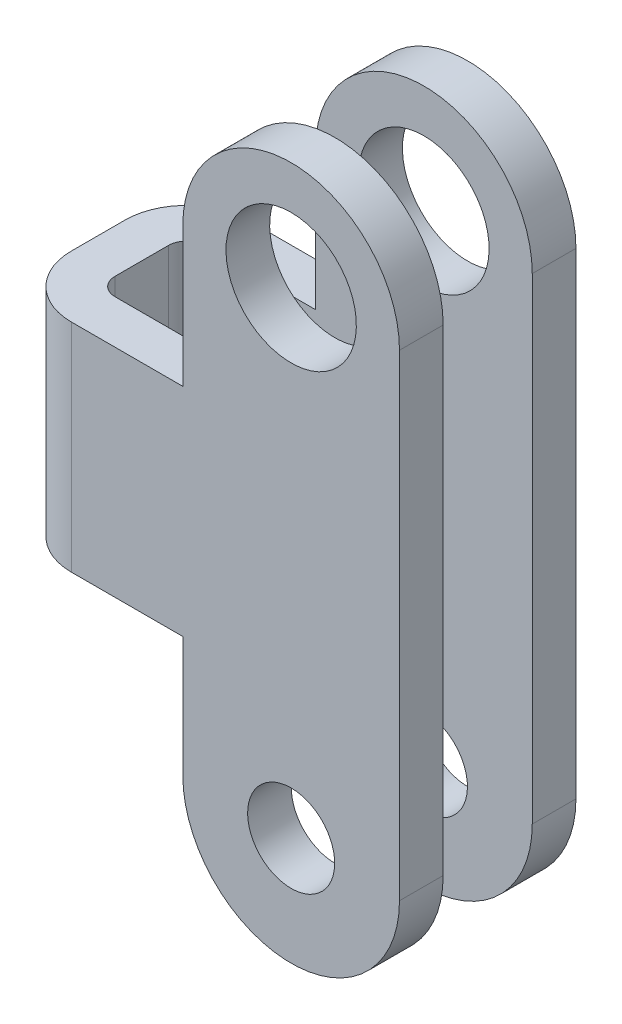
ISO-10303-21;
HEADER;
FILE_DESCRIPTION(('STEP AP214'),'2;1');
FILE_NAME('part.step','',(''),(''),'','','');
FILE_SCHEMA(('AUTOMOTIVE_DESIGN { 1 0 10303 214 1 1 1 1 }'));
ENDSEC;
DATA;
#1=APPLICATION_CONTEXT('core data for automotive mechanical design processes');
#2=APPLICATION_PROTOCOL_DEFINITION('international standard','automotive_design',2000,#1);
#3=PRODUCT_CONTEXT('',#1,'mechanical');
#4=PRODUCT('Part','Part','',(#3));
#5=PRODUCT_RELATED_PRODUCT_CATEGORY('part','',(#4));
#6=PRODUCT_DEFINITION_FORMATION('','',#4);
#7=PRODUCT_DEFINITION_CONTEXT('part definition',#1,'design');
#8=PRODUCT_DEFINITION('design','',#6,#7);
#9=PRODUCT_DEFINITION_SHAPE('','',#8);
#10=(LENGTH_UNIT() NAMED_UNIT(*) SI_UNIT(.MILLI.,.METRE.));
#11=(NAMED_UNIT(*) PLANE_ANGLE_UNIT() SI_UNIT($,.RADIAN.));
#12=(NAMED_UNIT(*) SI_UNIT($,.STERADIAN.) SOLID_ANGLE_UNIT());
#13=UNCERTAINTY_MEASURE_WITH_UNIT(LENGTH_MEASURE(1.E-05),#10,'distance_accuracy_value','');
#14=(GEOMETRIC_REPRESENTATION_CONTEXT(3) GLOBAL_UNCERTAINTY_ASSIGNED_CONTEXT((#13)) GLOBAL_UNIT_ASSIGNED_CONTEXT((#10,
#11,#12)) REPRESENTATION_CONTEXT('',''));
#15=CARTESIAN_POINT('',(0.,0.,0.));
#16=DIRECTION('',(0.,0.,1.));
#17=DIRECTION('',(1.,0.,0.));
#18=AXIS2_PLACEMENT_3D('',#15,#16,#17);
#19=CARTESIAN_POINT('',(328.945980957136,195.039056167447,0.));
#20=DIRECTION('',(0.,0.,1.));
#21=DIRECTION('',(1.,0.,0.));
#22=AXIS2_PLACEMENT_3D('',#19,#20,#21);
#23=CYLINDRICAL_SURFACE('',#22,7.935);
#24=CARTESIAN_POINT('',(328.945980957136,195.039056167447,12.925));
#25=DIRECTION('',(0.,0.,1.));
#26=DIRECTION('',(1.,0.,0.));
#27=AXIS2_PLACEMENT_3D('',#24,#25,#26);
#28=CIRCLE('',#27,7.935);
#29=CARTESIAN_POINT('',(321.010980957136,195.039056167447,12.925));
#30=VERTEX_POINT('',#29);
#31=CARTESIAN_POINT('',(336.880980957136,195.039056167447,12.925));
#32=VERTEX_POINT('',#31);
#33=EDGE_CURVE('E152',#30,#32,#28,.T.);
#34=ORIENTED_EDGE('',*,*,#33,.F.);
#35=DIRECTION('',(0.,0.,1.));
#36=VECTOR('',#35,1.);
#37=CARTESIAN_POINT('',(321.010980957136,195.039056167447,0.));
#38=LINE('',#37,#36);
#39=CARTESIAN_POINT('',(321.010980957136,195.039056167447,9.725));
#40=VERTEX_POINT('',#39);
#41=EDGE_CURVE('E145',#40,#30,#38,.T.);
#42=ORIENTED_EDGE('',*,*,#41,.F.);
#43=CARTESIAN_POINT('',(328.945980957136,195.039056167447,9.725));
#44=DIRECTION('',(0.,0.,1.));
#45=DIRECTION('',(1.,0.,0.));
#46=AXIS2_PLACEMENT_3D('',#43,#44,#45);
#47=CIRCLE('',#46,7.935);
#48=CARTESIAN_POINT('',(336.880980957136,195.039056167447,9.725));
#49=VERTEX_POINT('',#48);
#50=EDGE_CURVE('E126',#40,#49,#47,.T.);
#51=ORIENTED_EDGE('',*,*,#50,.T.);
#52=DIRECTION('',(0.,0.,-1.));
#53=VECTOR('',#52,1.);
#54=CARTESIAN_POINT('',(336.880980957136,195.039056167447,0.));
#55=LINE('',#54,#53);
#56=EDGE_CURVE('E157',#32,#49,#55,.T.);
#57=ORIENTED_EDGE('',*,*,#56,.F.);
#58=EDGE_LOOP('',(#34,#42,#51,#57));
#59=FACE_BOUND('',#58,.T.);
#60=ADVANCED_FACE('F15',(#59),#23,.T.);
#61=CARTESIAN_POINT('',(336.880980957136,229.959056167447,0.));
#62=DIRECTION('',(1.,0.,0.));
#63=DIRECTION('',(0.,0.,-1.));
#64=AXIS2_PLACEMENT_3D('',#61,#62,#63);
#65=PLANE('',#64);
#66=DIRECTION('',(0.,-1.,0.));
#67=VECTOR('',#66,1.);
#68=CARTESIAN_POINT('',(336.880980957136,212.376796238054,12.925));
#69=LINE('',#68,#67);
#70=CARTESIAN_POINT('',(336.880980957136,229.959056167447,12.925));
#71=VERTEX_POINT('',#70);
#72=EDGE_CURVE('E226',#32,#71,#69,.F.);
#73=ORIENTED_EDGE('',*,*,#72,.F.);
#74=ORIENTED_EDGE('',*,*,#56,.T.);
#75=DIRECTION('',(0.,-1.,0.));
#76=VECTOR('',#75,1.);
#77=CARTESIAN_POINT('',(336.880980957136,193.864056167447,9.725));
#78=LINE('',#77,#76);
#79=CARTESIAN_POINT('',(336.880980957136,229.959056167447,9.725));
#80=VERTEX_POINT('',#79);
#81=EDGE_CURVE('E136',#49,#80,#78,.F.);
#82=ORIENTED_EDGE('',*,*,#81,.T.);
#83=DIRECTION('',(0.,0.,1.));
#84=VECTOR('',#83,1.);
#85=CARTESIAN_POINT('',(336.880980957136,229.959056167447,0.));
#86=LINE('',#85,#84);
#87=EDGE_CURVE('E237',#71,#80,#86,.F.);
#88=ORIENTED_EDGE('',*,*,#87,.F.);
#89=EDGE_LOOP('',(#73,#74,#82,#88));
#90=FACE_BOUND('',#89,.T.);
#91=ADVANCED_FACE('F396',(#90),#65,.T.);
#92=CARTESIAN_POINT('',(328.945980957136,229.959056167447,0.));
#93=DIRECTION('',(0.,0.,1.));
#94=DIRECTION('',(1.,0.,0.));
#95=AXIS2_PLACEMENT_3D('',#92,#93,#94);
#96=CYLINDRICAL_SURFACE('',#95,7.935);
#97=CARTESIAN_POINT('',(328.945980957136,229.959056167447,12.925));
#98=DIRECTION('',(0.,0.,1.));
#99=DIRECTION('',(1.,0.,0.));
#100=AXIS2_PLACEMENT_3D('',#97,#98,#99);
#101=CIRCLE('',#100,7.935);
#102=CARTESIAN_POINT('',(321.010980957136,229.959056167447,12.925));
#103=VERTEX_POINT('',#102);
#104=EDGE_CURVE('E224',#71,#103,#101,.T.);
#105=ORIENTED_EDGE('',*,*,#104,.F.);
#106=ORIENTED_EDGE('',*,*,#87,.T.);
#107=CARTESIAN_POINT('',(328.945980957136,229.959056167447,9.725));
#108=DIRECTION('',(0.,0.,1.));
#109=DIRECTION('',(1.,0.,0.));
#110=AXIS2_PLACEMENT_3D('',#107,#108,#109);
#111=CIRCLE('',#110,7.935);
#112=CARTESIAN_POINT('',(321.010980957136,229.959056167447,9.725));
#113=VERTEX_POINT('',#112);
#114=EDGE_CURVE('E228',#80,#113,#111,.T.);
#115=ORIENTED_EDGE('',*,*,#114,.T.);
#116=DIRECTION('',(0.,0.,1.));
#117=VECTOR('',#116,1.);
#118=CARTESIAN_POINT('',(321.010980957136,229.959056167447,0.));
#119=LINE('',#118,#117);
#120=EDGE_CURVE('E234',#103,#113,#119,.F.);
#121=ORIENTED_EDGE('',*,*,#120,.F.);
#122=EDGE_LOOP('',(#105,#106,#115,#121));
#123=FACE_BOUND('',#122,.T.);
#124=ADVANCED_FACE('F392',(#123),#96,.T.);
#125=CARTESIAN_POINT('',(328.945980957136,195.039056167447,-46.7484945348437));
#126=DIRECTION('',(0.,0.,-1.));
#127=DIRECTION('',(0.,1.,0.));
#128=AXIS2_PLACEMENT_3D('',#125,#126,#127);
#129=CYLINDRICAL_SURFACE('',#128,3.1875);
#130=CARTESIAN_POINT('',(328.945980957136,195.039056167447,12.925));
#131=DIRECTION('',(0.,0.,-1.));
#132=DIRECTION('',(0.,1.,0.));
#133=AXIS2_PLACEMENT_3D('',#130,#131,#132);
#134=CIRCLE('',#133,3.1875);
#135=CARTESIAN_POINT('',(328.945980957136,198.226556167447,12.925));
#136=VERTEX_POINT('',#135);
#137=EDGE_CURVE('E220',#136,#136,#134,.T.);
#138=ORIENTED_EDGE('',*,*,#137,.F.);
#139=EDGE_LOOP('',(#138));
#140=FACE_BOUND('',#139,.T.);
#141=CARTESIAN_POINT('',(328.945980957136,195.039056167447,9.725));
#142=DIRECTION('',(0.,0.,-1.));
#143=DIRECTION('',(0.,1.,0.));
#144=AXIS2_PLACEMENT_3D('',#141,#142,#143);
#145=CIRCLE('',#144,3.1875);
#146=CARTESIAN_POINT('',(328.945980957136,198.226556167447,9.725));
#147=VERTEX_POINT('',#146);
#148=EDGE_CURVE('E140',#147,#147,#145,.T.);
#149=ORIENTED_EDGE('',*,*,#148,.T.);
#150=EDGE_LOOP('',(#149));
#151=FACE_BOUND('',#150,.T.);
#152=ADVANCED_FACE('F591',(#140,#151),#129,.F.);
#153=CARTESIAN_POINT('',(328.945980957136,229.959056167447,-46.7484945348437));
#154=DIRECTION('',(0.,0.,-1.));
#155=DIRECTION('',(0.,1.,0.));
#156=AXIS2_PLACEMENT_3D('',#153,#154,#155);
#157=CYLINDRICAL_SURFACE('',#156,4.775);
#158=CARTESIAN_POINT('',(328.945980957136,229.959056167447,12.925));
#159=DIRECTION('',(0.,0.,-1.));
#160=DIRECTION('',(0.,1.,0.));
#161=AXIS2_PLACEMENT_3D('',#158,#159,#160);
#162=CIRCLE('',#161,4.775);
#163=CARTESIAN_POINT('',(328.945980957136,234.734056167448,12.925));
#164=VERTEX_POINT('',#163);
#165=EDGE_CURVE('E216',#164,#164,#162,.T.);
#166=ORIENTED_EDGE('',*,*,#165,.F.);
#167=EDGE_LOOP('',(#166));
#168=FACE_BOUND('',#167,.T.);
#169=CARTESIAN_POINT('',(328.945980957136,229.959056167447,9.725));
#170=DIRECTION('',(0.,0.,-1.));
#171=DIRECTION('',(0.,1.,0.));
#172=AXIS2_PLACEMENT_3D('',#169,#170,#171);
#173=CIRCLE('',#172,4.775);
#174=CARTESIAN_POINT('',(328.945980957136,234.734056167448,9.725));
#175=VERTEX_POINT('',#174);
#176=EDGE_CURVE('E18',#175,#175,#173,.T.);
#177=ORIENTED_EDGE('',*,*,#176,.T.);
#178=EDGE_LOOP('',(#177));
#179=FACE_BOUND('',#178,.T.);
#180=ADVANCED_FACE('F583',(#168,#179),#157,.F.);
#181=CARTESIAN_POINT('',(321.010980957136,219.734056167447,0.));
#182=DIRECTION('',(-1.,0.,0.));
#183=DIRECTION('',(0.,-1.,0.));
#184=AXIS2_PLACEMENT_3D('',#181,#182,#183);
#185=PLANE('',#184);
#186=DIRECTION('',(0.,-1.,0.));
#187=VECTOR('',#186,1.);
#188=CARTESIAN_POINT('',(321.010980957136,212.376796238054,12.925));
#189=LINE('',#188,#187);
#190=CARTESIAN_POINT('',(321.010980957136,219.734056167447,12.925));
#191=VERTEX_POINT('',#190);
#192=EDGE_CURVE('E223',#103,#191,#189,.T.);
#193=ORIENTED_EDGE('',*,*,#192,.F.);
#194=ORIENTED_EDGE('',*,*,#120,.T.);
#195=DIRECTION('',(0.,-1.,0.));
#196=VECTOR('',#195,1.);
#197=CARTESIAN_POINT('',(321.010980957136,193.864056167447,9.725));
#198=LINE('',#197,#196);
#199=CARTESIAN_POINT('',(321.010980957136,219.734056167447,9.725));
#200=VERTEX_POINT('',#199);
#201=EDGE_CURVE('E149',#113,#200,#198,.T.);
#202=ORIENTED_EDGE('',*,*,#201,.T.);
#203=DIRECTION('',(0.,0.,1.));
#204=VECTOR('',#203,1.);
#205=CARTESIAN_POINT('',(321.010980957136,219.734056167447,0.));
#206=LINE('',#205,#204);
#207=EDGE_CURVE('E245',#191,#200,#206,.F.);
#208=ORIENTED_EDGE('',*,*,#207,.F.);
#209=EDGE_LOOP('',(#193,#194,#202,#208));
#210=FACE_BOUND('',#209,.T.);
#211=ADVANCED_FACE('F387',(#210),#185,.T.);
#212=CARTESIAN_POINT('',(311.545980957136,193.864056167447,9.725));
#213=DIRECTION('',(0.,0.,1.));
#214=DIRECTION('',(0.,-1.,0.));
#215=AXIS2_PLACEMENT_3D('',#212,#213,#214);
#216=PLANE('',#215);
#217=DIRECTION('',(1.,0.,0.));
#218=VECTOR('',#217,1.);
#219=CARTESIAN_POINT('',(308.345980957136,219.734056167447,9.725));
#220=LINE('',#219,#218);
#221=CARTESIAN_POINT('',(312.845980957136,219.734056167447,9.725));
#222=VERTEX_POINT('',#221);
#223=EDGE_CURVE('E215',#200,#222,#220,.F.);
#224=ORIENTED_EDGE('',*,*,#223,.F.);
#225=ORIENTED_EDGE('',*,*,#201,.F.);
#226=ORIENTED_EDGE('',*,*,#114,.F.);
#227=ORIENTED_EDGE('',*,*,#81,.F.);
#228=ORIENTED_EDGE('',*,*,#50,.F.);
#229=DIRECTION('',(0.,-1.,0.));
#230=VECTOR('',#229,1.);
#231=CARTESIAN_POINT('',(321.010980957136,195.039056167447,9.725));
#232=LINE('',#231,#230);
#233=CARTESIAN_POINT('',(321.010980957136,203.864056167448,9.725));
#234=VERTEX_POINT('',#233);
#235=EDGE_CURVE('E132',#234,#40,#232,.T.);
#236=ORIENTED_EDGE('',*,*,#235,.F.);
#237=DIRECTION('',(1.,0.,0.));
#238=VECTOR('',#237,1.);
#239=CARTESIAN_POINT('',(321.010980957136,203.864056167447,9.725));
#240=LINE('',#239,#238);
#241=CARTESIAN_POINT('',(312.845980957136,203.864056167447,9.725));
#242=VERTEX_POINT('',#241);
#243=EDGE_CURVE('E255',#242,#234,#240,.T.);
#244=ORIENTED_EDGE('',*,*,#243,.F.);
#245=DIRECTION('',(0.,-1.,0.));
#246=VECTOR('',#245,1.);
#247=CARTESIAN_POINT('',(312.845980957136,193.864056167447,9.725));
#248=LINE('',#247,#246);
#249=EDGE_CURVE('E265',#222,#242,#248,.T.);
#250=ORIENTED_EDGE('',*,*,#249,.F.);
#251=EDGE_LOOP('',(#224,#225,#226,#227,#228,#236,#244,#250));
#252=FACE_BOUND('',#251,.T.);
#253=ORIENTED_EDGE('',*,*,#148,.F.);
#254=EDGE_LOOP('',(#253));
#255=FACE_BOUND('',#254,.T.);
#256=ORIENTED_EDGE('',*,*,#176,.F.);
#257=EDGE_LOOP('',(#256));
#258=FACE_BOUND('',#257,.T.);
#259=ADVANCED_FACE('F129',(#252,#255,#258),#216,.F.);
#260=CARTESIAN_POINT('',(321.010980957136,195.039056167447,0.));
#261=DIRECTION('',(-1.,0.,0.));
#262=DIRECTION('',(0.,-1.,0.));
#263=AXIS2_PLACEMENT_3D('',#260,#261,#262);
#264=PLANE('',#263);
#265=DIRECTION('',(0.,-1.,0.));
#266=VECTOR('',#265,1.);
#267=CARTESIAN_POINT('',(321.010980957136,212.376796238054,12.925));
#268=LINE('',#267,#266);
#269=CARTESIAN_POINT('',(321.010980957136,203.864056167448,12.925));
#270=VERTEX_POINT('',#269);
#271=EDGE_CURVE('E153',#270,#30,#268,.T.);
#272=ORIENTED_EDGE('',*,*,#271,.F.);
#273=DIRECTION('',(0.,0.,1.));
#274=VECTOR('',#273,1.);
#275=CARTESIAN_POINT('',(321.010980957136,203.864056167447,0.));
#276=LINE('',#275,#274);
#277=EDGE_CURVE('E148',#234,#270,#276,.T.);
#278=ORIENTED_EDGE('',*,*,#277,.F.);
#279=ORIENTED_EDGE('',*,*,#235,.T.);
#280=ORIENTED_EDGE('',*,*,#41,.T.);
#281=EDGE_LOOP('',(#272,#278,#279,#280));
#282=FACE_BOUND('',#281,.T.);
#283=ADVANCED_FACE('F144',(#282),#264,.T.);
#284=CARTESIAN_POINT('',(325.068157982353,212.376796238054,12.925));
#285=DIRECTION('',(0.,0.,1.));
#286=DIRECTION('',(0.,-1.,0.));
#287=AXIS2_PLACEMENT_3D('',#284,#285,#286);
#288=PLANE('',#287);
#289=ORIENTED_EDGE('',*,*,#165,.T.);
#290=EDGE_LOOP('',(#289));
#291=FACE_BOUND('',#290,.T.);
#292=ORIENTED_EDGE('',*,*,#137,.T.);
#293=EDGE_LOOP('',(#292));
#294=FACE_BOUND('',#293,.T.);
#295=ORIENTED_EDGE('',*,*,#192,.T.);
#296=DIRECTION('',(1.,0.,0.));
#297=VECTOR('',#296,1.);
#298=CARTESIAN_POINT('',(308.345980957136,219.734056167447,12.925));
#299=LINE('',#298,#297);
#300=CARTESIAN_POINT('',(312.845980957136,219.734056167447,12.925));
#301=VERTEX_POINT('',#300);
#302=EDGE_CURVE('E206',#301,#191,#299,.T.);
#303=ORIENTED_EDGE('',*,*,#302,.F.);
#304=DIRECTION('',(0.,1.,0.));
#305=VECTOR('',#304,1.);
#306=CARTESIAN_POINT('',(312.845980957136,208.120426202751,12.925));
#307=LINE('',#306,#305);
#308=CARTESIAN_POINT('',(312.845980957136,203.864056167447,12.925));
#309=VERTEX_POINT('',#308);
#310=EDGE_CURVE('E219',#309,#301,#307,.T.);
#311=ORIENTED_EDGE('',*,*,#310,.F.);
#312=DIRECTION('',(1.,0.,0.));
#313=VECTOR('',#312,1.);
#314=CARTESIAN_POINT('',(321.010980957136,203.864056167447,12.925));
#315=LINE('',#314,#313);
#316=EDGE_CURVE('E194',#270,#309,#315,.F.);
#317=ORIENTED_EDGE('',*,*,#316,.F.);
#318=ORIENTED_EDGE('',*,*,#271,.T.);
#319=ORIENTED_EDGE('',*,*,#33,.T.);
#320=ORIENTED_EDGE('',*,*,#72,.T.);
#321=ORIENTED_EDGE('',*,*,#104,.T.);
#322=EDGE_LOOP('',(#295,#303,#311,#317,#318,#319,#320,#321));
#323=FACE_BOUND('',#322,.T.);
#324=ADVANCED_FACE('F384',(#291,#294,#323),#288,.T.);
#325=CARTESIAN_POINT('',(312.845980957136,208.120426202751,8.425));
#326=DIRECTION('',(0.,1.,0.));
#327=DIRECTION('',(0.,0.,1.));
#328=AXIS2_PLACEMENT_3D('',#325,#326,#327);
#329=CYLINDRICAL_SURFACE('',#328,4.5);
#330=CARTESIAN_POINT('',(312.845980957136,203.864056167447,8.425));
#331=DIRECTION('',(0.,1.,0.));
#332=DIRECTION('',(0.,0.,1.));
#333=AXIS2_PLACEMENT_3D('',#330,#331,#332);
#334=CIRCLE('',#333,4.5);
#335=CARTESIAN_POINT('',(308.345980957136,203.864056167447,8.425));
#336=VERTEX_POINT('',#335);
#337=EDGE_CURVE('E192',#309,#336,#334,.F.);
#338=ORIENTED_EDGE('',*,*,#337,.F.);
#339=ORIENTED_EDGE('',*,*,#310,.T.);
#340=CARTESIAN_POINT('',(312.845980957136,219.734056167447,8.425));
#341=DIRECTION('',(0.,1.,0.));
#342=DIRECTION('',(0.,0.,1.));
#343=AXIS2_PLACEMENT_3D('',#340,#341,#342);
#344=CIRCLE('',#343,4.5);
#345=CARTESIAN_POINT('',(308.345980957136,219.734056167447,8.425));
#346=VERTEX_POINT('',#345);
#347=EDGE_CURVE('E203',#346,#301,#344,.T.);
#348=ORIENTED_EDGE('',*,*,#347,.F.);
#349=DIRECTION('',(0.,1.,0.));
#350=VECTOR('',#349,1.);
#351=CARTESIAN_POINT('',(308.345980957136,203.864056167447,8.425));
#352=LINE('',#351,#350);
#353=EDGE_CURVE('E261',#336,#346,#352,.T.);
#354=ORIENTED_EDGE('',*,*,#353,.F.);
#355=EDGE_LOOP('',(#338,#339,#348,#354));
#356=FACE_BOUND('',#355,.T.);
#357=ADVANCED_FACE('F380',(#356),#329,.T.);
#358=CARTESIAN_POINT('',(308.345980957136,203.864056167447,0.));
#359=DIRECTION('',(-1.,0.,0.));
#360=DIRECTION('',(0.,0.,1.));
#361=AXIS2_PLACEMENT_3D('',#358,#359,#360);
#362=PLANE('',#361);
#363=ORIENTED_EDGE('',*,*,#353,.T.);
#364=DIRECTION('',(0.,0.,1.));
#365=VECTOR('',#364,1.);
#366=CARTESIAN_POINT('',(308.345980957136,219.734056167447,0.));
#367=LINE('',#366,#365);
#368=CARTESIAN_POINT('',(308.345980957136,219.734056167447,4.5));
#369=VERTEX_POINT('',#368);
#370=EDGE_CURVE('E207',#369,#346,#367,.T.);
#371=ORIENTED_EDGE('',*,*,#370,.F.);
#372=DIRECTION('',(0.,1.,0.));
#373=VECTOR('',#372,1.);
#374=CARTESIAN_POINT('',(308.345980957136,208.120426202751,4.5));
#375=LINE('',#374,#373);
#376=CARTESIAN_POINT('',(308.345980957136,203.864056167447,4.5));
#377=VERTEX_POINT('',#376);
#378=EDGE_CURVE('E263',#377,#369,#375,.T.);
#379=ORIENTED_EDGE('',*,*,#378,.F.);
#380=DIRECTION('',(0.,0.,1.));
#381=VECTOR('',#380,1.);
#382=CARTESIAN_POINT('',(308.345980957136,203.864056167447,0.));
#383=LINE('',#382,#381);
#384=EDGE_CURVE('E191',#336,#377,#383,.F.);
#385=ORIENTED_EDGE('',*,*,#384,.F.);
#386=EDGE_LOOP('',(#363,#371,#379,#385));
#387=FACE_BOUND('',#386,.T.);
#388=ADVANCED_FACE('F374',(#387),#362,.T.);
#389=CARTESIAN_POINT('',(312.845980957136,208.120426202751,4.5));
#390=DIRECTION('',(0.,1.,0.));
#391=DIRECTION('',(0.,0.,1.));
#392=AXIS2_PLACEMENT_3D('',#389,#390,#391);
#393=CYLINDRICAL_SURFACE('',#392,4.5);
#394=CARTESIAN_POINT('',(312.845980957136,203.864056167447,4.5));
#395=DIRECTION('',(0.,1.,0.));
#396=DIRECTION('',(0.,0.,1.));
#397=AXIS2_PLACEMENT_3D('',#394,#395,#396);
#398=CIRCLE('',#397,4.5);
#399=CARTESIAN_POINT('',(312.845980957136,203.864056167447,0.));
#400=VERTEX_POINT('',#399);
#401=EDGE_CURVE('E188',#377,#400,#398,.F.);
#402=ORIENTED_EDGE('',*,*,#401,.F.);
#403=ORIENTED_EDGE('',*,*,#378,.T.);
#404=CARTESIAN_POINT('',(312.845980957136,219.734056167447,4.5));
#405=DIRECTION('',(0.,1.,0.));
#406=DIRECTION('',(0.,0.,1.));
#407=AXIS2_PLACEMENT_3D('',#404,#405,#406);
#408=CIRCLE('',#407,4.5);
#409=CARTESIAN_POINT('',(312.845980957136,219.734056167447,0.));
#410=VERTEX_POINT('',#409);
#411=EDGE_CURVE('E208',#410,#369,#408,.T.);
#412=ORIENTED_EDGE('',*,*,#411,.F.);
#413=DIRECTION('',(0.,-1.,0.));
#414=VECTOR('',#413,1.);
#415=CARTESIAN_POINT('',(312.845980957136,212.376796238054,0.));
#416=LINE('',#415,#414);
#417=EDGE_CURVE('E266',#410,#400,#416,.T.);
#418=ORIENTED_EDGE('',*,*,#417,.T.);
#419=EDGE_LOOP('',(#402,#403,#412,#418));
#420=FACE_BOUND('',#419,.T.);
#421=ADVANCED_FACE('F370',(#420),#393,.T.);
#422=CARTESIAN_POINT('',(312.845980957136,219.734056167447,8.425));
#423=DIRECTION('',(0.,-1.,0.));
#424=DIRECTION('',(1.,0.,0.));
#425=AXIS2_PLACEMENT_3D('',#422,#423,#424);
#426=CYLINDRICAL_SURFACE('',#425,1.3);
#427=CARTESIAN_POINT('',(312.845980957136,203.864056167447,8.425));
#428=DIRECTION('',(0.,-1.,0.));
#429=DIRECTION('',(1.,0.,0.));
#430=AXIS2_PLACEMENT_3D('',#427,#428,#429);
#431=CIRCLE('',#430,1.3);
#432=CARTESIAN_POINT('',(311.545980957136,203.864056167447,8.425));
#433=VERTEX_POINT('',#432);
#434=EDGE_CURVE('E184',#433,#242,#431,.F.);
#435=ORIENTED_EDGE('',*,*,#434,.F.);
#436=DIRECTION('',(0.,-1.,0.));
#437=VECTOR('',#436,1.);
#438=CARTESIAN_POINT('',(311.545980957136,193.864056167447,8.425));
#439=LINE('',#438,#437);
#440=CARTESIAN_POINT('',(311.545980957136,219.734056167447,8.425));
#441=VERTEX_POINT('',#440);
#442=EDGE_CURVE('E269',#433,#441,#439,.F.);
#443=ORIENTED_EDGE('',*,*,#442,.T.);
#444=CARTESIAN_POINT('',(312.845980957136,219.734056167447,8.425));
#445=DIRECTION('',(0.,-1.,0.));
#446=DIRECTION('',(1.,0.,0.));
#447=AXIS2_PLACEMENT_3D('',#444,#445,#446);
#448=CIRCLE('',#447,1.3);
#449=EDGE_CURVE('E212',#222,#441,#448,.T.);
#450=ORIENTED_EDGE('',*,*,#449,.F.);
#451=ORIENTED_EDGE('',*,*,#249,.T.);
#452=EDGE_LOOP('',(#435,#443,#450,#451));
#453=FACE_BOUND('',#452,.T.);
#454=ADVANCED_FACE('F403',(#453),#426,.F.);
#455=CARTESIAN_POINT('',(311.545980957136,193.864056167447,3.2));
#456=DIRECTION('',(-1.,0.,0.));
#457=DIRECTION('',(0.,-1.,0.));
#458=AXIS2_PLACEMENT_3D('',#455,#456,#457);
#459=PLANE('',#458);
#460=DIRECTION('',(0.,0.,1.));
#461=VECTOR('',#460,1.);
#462=CARTESIAN_POINT('',(311.545980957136,219.734056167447,0.));
#463=LINE('',#462,#461);
#464=CARTESIAN_POINT('',(311.545980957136,219.734056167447,4.5));
#465=VERTEX_POINT('',#464);
#466=EDGE_CURVE('E214',#441,#465,#463,.F.);
#467=ORIENTED_EDGE('',*,*,#466,.F.);
#468=ORIENTED_EDGE('',*,*,#442,.F.);
#469=DIRECTION('',(0.,0.,1.));
#470=VECTOR('',#469,1.);
#471=CARTESIAN_POINT('',(311.545980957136,203.864056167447,0.));
#472=LINE('',#471,#470);
#473=CARTESIAN_POINT('',(311.545980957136,203.864056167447,4.5));
#474=VERTEX_POINT('',#473);
#475=EDGE_CURVE('E187',#474,#433,#472,.T.);
#476=ORIENTED_EDGE('',*,*,#475,.F.);
#477=DIRECTION('',(0.,-1.,0.));
#478=VECTOR('',#477,1.);
#479=CARTESIAN_POINT('',(311.545980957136,193.864056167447,4.5));
#480=LINE('',#479,#478);
#481=EDGE_CURVE('E180',#465,#474,#480,.T.);
#482=ORIENTED_EDGE('',*,*,#481,.F.);
#483=EDGE_LOOP('',(#467,#468,#476,#482));
#484=FACE_BOUND('',#483,.T.);
#485=ADVANCED_FACE('F406',(#484),#459,.F.);
#486=CARTESIAN_POINT('',(325.068157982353,212.376796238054,0.));
#487=DIRECTION('',(0.,0.,1.));
#488=DIRECTION('',(0.,-1.,0.));
#489=AXIS2_PLACEMENT_3D('',#486,#487,#488);
#490=PLANE('',#489);
#491=CARTESIAN_POINT('',(328.945980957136,195.039056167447,0.));
#492=DIRECTION('',(0.,0.,-1.));
#493=DIRECTION('',(0.,1.,0.));
#494=AXIS2_PLACEMENT_3D('',#491,#492,#493);
#495=CIRCLE('',#494,3.1875);
#496=CARTESIAN_POINT('',(328.945980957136,198.226556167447,0.));
#497=VERTEX_POINT('',#496);
#498=EDGE_CURVE('E172',#497,#497,#495,.F.);
#499=ORIENTED_EDGE('',*,*,#498,.T.);
#500=EDGE_LOOP('',(#499));
#501=FACE_BOUND('',#500,.T.);
#502=CARTESIAN_POINT('',(328.945980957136,229.959056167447,0.));
#503=DIRECTION('',(0.,0.,-1.));
#504=DIRECTION('',(0.,1.,0.));
#505=AXIS2_PLACEMENT_3D('',#502,#503,#504);
#506=CIRCLE('',#505,4.775);
#507=CARTESIAN_POINT('',(328.945980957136,234.734056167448,0.));
#508=VERTEX_POINT('',#507);
#509=EDGE_CURVE('E176',#508,#508,#506,.F.);
#510=ORIENTED_EDGE('',*,*,#509,.T.);
#511=EDGE_LOOP('',(#510));
#512=FACE_BOUND('',#511,.T.);
#513=DIRECTION('',(1.,0.,0.));
#514=VECTOR('',#513,1.);
#515=CARTESIAN_POINT('',(308.345980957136,219.734056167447,0.));
#516=LINE('',#515,#514);
#517=CARTESIAN_POINT('',(321.010980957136,219.734056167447,0.));
#518=VERTEX_POINT('',#517);
#519=EDGE_CURVE('E211',#518,#410,#516,.F.);
#520=ORIENTED_EDGE('',*,*,#519,.F.);
#521=DIRECTION('',(0.,-1.,0.));
#522=VECTOR('',#521,1.);
#523=CARTESIAN_POINT('',(321.010980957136,219.734056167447,0.));
#524=LINE('',#523,#522);
#525=CARTESIAN_POINT('',(321.010980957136,229.959056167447,0.));
#526=VERTEX_POINT('',#525);
#527=EDGE_CURVE('E248',#526,#518,#524,.T.);
#528=ORIENTED_EDGE('',*,*,#527,.F.);
#529=CARTESIAN_POINT('',(328.945980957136,229.959056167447,0.));
#530=DIRECTION('',(0.,0.,1.));
#531=DIRECTION('',(1.,0.,0.));
#532=AXIS2_PLACEMENT_3D('',#529,#530,#531);
#533=CIRCLE('',#532,7.935);
#534=CARTESIAN_POINT('',(336.880980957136,229.959056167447,0.));
#535=VERTEX_POINT('',#534);
#536=EDGE_CURVE('E199',#535,#526,#533,.T.);
#537=ORIENTED_EDGE('',*,*,#536,.F.);
#538=DIRECTION('',(0.,1.,0.));
#539=VECTOR('',#538,1.);
#540=CARTESIAN_POINT('',(336.880980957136,229.959056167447,0.));
#541=LINE('',#540,#539);
#542=CARTESIAN_POINT('',(336.880980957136,195.039056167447,0.));
#543=VERTEX_POINT('',#542);
#544=EDGE_CURVE('E251',#543,#535,#541,.T.);
#545=ORIENTED_EDGE('',*,*,#544,.F.);
#546=CARTESIAN_POINT('',(328.945980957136,195.039056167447,0.));
#547=DIRECTION('',(0.,0.,1.));
#548=DIRECTION('',(1.,0.,0.));
#549=AXIS2_PLACEMENT_3D('',#546,#547,#548);
#550=CIRCLE('',#549,7.935);
#551=CARTESIAN_POINT('',(321.010980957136,195.039056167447,0.));
#552=VERTEX_POINT('',#551);
#553=EDGE_CURVE('E195',#552,#543,#550,.T.);
#554=ORIENTED_EDGE('',*,*,#553,.F.);
#555=DIRECTION('',(0.,-1.,0.));
#556=VECTOR('',#555,1.);
#557=CARTESIAN_POINT('',(321.010980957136,195.039056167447,0.));
#558=LINE('',#557,#556);
#559=CARTESIAN_POINT('',(321.010980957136,203.864056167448,0.));
#560=VERTEX_POINT('',#559);
#561=EDGE_CURVE('E270',#560,#552,#558,.T.);
#562=ORIENTED_EDGE('',*,*,#561,.F.);
#563=DIRECTION('',(1.,0.,0.));
#564=VECTOR('',#563,1.);
#565=CARTESIAN_POINT('',(321.010980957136,203.864056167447,0.));
#566=LINE('',#565,#564);
#567=EDGE_CURVE('E190',#400,#560,#566,.T.);
#568=ORIENTED_EDGE('',*,*,#567,.F.);
#569=ORIENTED_EDGE('',*,*,#417,.F.);
#570=EDGE_LOOP('',(#520,#528,#537,#545,#554,#562,#568,#569));
#571=FACE_BOUND('',#570,.T.);
#572=ADVANCED_FACE('F365',(#501,#512,#571),#490,.F.);
#573=CARTESIAN_POINT('',(308.345980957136,219.734056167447,0.));
#574=DIRECTION('',(0.,1.,0.));
#575=DIRECTION('',(0.,0.,1.));
#576=AXIS2_PLACEMENT_3D('',#573,#574,#575);
#577=PLANE('',#576);
#578=ORIENTED_EDGE('',*,*,#302,.T.);
#579=ORIENTED_EDGE('',*,*,#207,.T.);
#580=ORIENTED_EDGE('',*,*,#223,.T.);
#581=ORIENTED_EDGE('',*,*,#449,.T.);
#582=ORIENTED_EDGE('',*,*,#466,.T.);
#583=CARTESIAN_POINT('',(312.845980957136,219.734056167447,4.5));
#584=DIRECTION('',(0.,-1.,0.));
#585=DIRECTION('',(1.,0.,0.));
#586=AXIS2_PLACEMENT_3D('',#583,#584,#585);
#587=CIRCLE('',#586,1.3);
#588=CARTESIAN_POINT('',(312.845980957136,219.734056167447,3.2));
#589=VERTEX_POINT('',#588);
#590=EDGE_CURVE('E181',#589,#465,#587,.F.);
#591=ORIENTED_EDGE('',*,*,#590,.F.);
#592=DIRECTION('',(-1.,0.,0.));
#593=VECTOR('',#592,1.);
#594=CARTESIAN_POINT('',(336.880980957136,219.734056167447,3.2));
#595=LINE('',#594,#593);
#596=CARTESIAN_POINT('',(321.010980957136,219.734056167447,3.2));
#597=VERTEX_POINT('',#596);
#598=EDGE_CURVE('E175',#589,#597,#595,.F.);
#599=ORIENTED_EDGE('',*,*,#598,.T.);
#600=DIRECTION('',(0.,0.,1.));
#601=VECTOR('',#600,1.);
#602=CARTESIAN_POINT('',(321.010980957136,219.734056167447,0.));
#603=LINE('',#602,#601);
#604=EDGE_CURVE('E202',#518,#597,#603,.T.);
#605=ORIENTED_EDGE('',*,*,#604,.F.);
#606=ORIENTED_EDGE('',*,*,#519,.T.);
#607=ORIENTED_EDGE('',*,*,#411,.T.);
#608=ORIENTED_EDGE('',*,*,#370,.T.);
#609=ORIENTED_EDGE('',*,*,#347,.T.);
#610=EDGE_LOOP('',(#578,#579,#580,#581,#582,#591,#599,#605,#606,#607,#608,#609));
#611=FACE_BOUND('',#610,.T.);
#612=ADVANCED_FACE('F354',(#611),#577,.T.);
#613=CARTESIAN_POINT('',(321.010980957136,219.734056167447,0.));
#614=DIRECTION('',(-1.,0.,0.));
#615=DIRECTION('',(0.,-1.,0.));
#616=AXIS2_PLACEMENT_3D('',#613,#614,#615);
#617=PLANE('',#616);
#618=ORIENTED_EDGE('',*,*,#527,.T.);
#619=ORIENTED_EDGE('',*,*,#604,.T.);
#620=DIRECTION('',(0.,1.,0.));
#621=VECTOR('',#620,1.);
#622=CARTESIAN_POINT('',(321.010980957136,193.864056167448,3.2));
#623=LINE('',#622,#621);
#624=CARTESIAN_POINT('',(321.010980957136,229.959056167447,3.2));
#625=VERTEX_POINT('',#624);
#626=EDGE_CURVE('E171',#597,#625,#623,.T.);
#627=ORIENTED_EDGE('',*,*,#626,.T.);
#628=DIRECTION('',(0.,0.,1.));
#629=VECTOR('',#628,1.);
#630=CARTESIAN_POINT('',(321.010980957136,229.959056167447,0.));
#631=LINE('',#630,#629);
#632=EDGE_CURVE('E201',#526,#625,#631,.T.);
#633=ORIENTED_EDGE('',*,*,#632,.F.);
#634=EDGE_LOOP('',(#618,#619,#627,#633));
#635=FACE_BOUND('',#634,.T.);
#636=ADVANCED_FACE('F348',(#635),#617,.T.);
#637=CARTESIAN_POINT('',(328.945980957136,229.959056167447,0.));
#638=DIRECTION('',(0.,0.,1.));
#639=DIRECTION('',(1.,0.,0.));
#640=AXIS2_PLACEMENT_3D('',#637,#638,#639);
#641=CYLINDRICAL_SURFACE('',#640,7.935);
#642=ORIENTED_EDGE('',*,*,#536,.T.);
#643=ORIENTED_EDGE('',*,*,#632,.T.);
#644=CARTESIAN_POINT('',(328.945980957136,229.959056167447,3.2));
#645=DIRECTION('',(0.,0.,1.));
#646=DIRECTION('',(1.,0.,0.));
#647=AXIS2_PLACEMENT_3D('',#644,#645,#646);
#648=CIRCLE('',#647,7.935);
#649=CARTESIAN_POINT('',(336.880980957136,229.959056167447,3.2));
#650=VERTEX_POINT('',#649);
#651=EDGE_CURVE('E168',#625,#650,#648,.F.);
#652=ORIENTED_EDGE('',*,*,#651,.T.);
#653=DIRECTION('',(0.,0.,-1.));
#654=VECTOR('',#653,1.);
#655=CARTESIAN_POINT('',(336.880980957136,229.959056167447,0.));
#656=LINE('',#655,#654);
#657=EDGE_CURVE('E198',#535,#650,#656,.F.);
#658=ORIENTED_EDGE('',*,*,#657,.F.);
#659=EDGE_LOOP('',(#642,#643,#652,#658));
#660=FACE_BOUND('',#659,.T.);
#661=ADVANCED_FACE('F343',(#660),#641,.T.);
#662=CARTESIAN_POINT('',(336.880980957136,229.959056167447,0.));
#663=DIRECTION('',(1.,0.,0.));
#664=DIRECTION('',(0.,0.,-1.));
#665=AXIS2_PLACEMENT_3D('',#662,#663,#664);
#666=PLANE('',#665);
#667=ORIENTED_EDGE('',*,*,#544,.T.);
#668=ORIENTED_EDGE('',*,*,#657,.T.);
#669=DIRECTION('',(0.,1.,0.));
#670=VECTOR('',#669,1.);
#671=CARTESIAN_POINT('',(336.880980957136,193.864056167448,3.2));
#672=LINE('',#671,#670);
#673=CARTESIAN_POINT('',(336.880980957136,195.039056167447,3.2));
#674=VERTEX_POINT('',#673);
#675=EDGE_CURVE('E167',#650,#674,#672,.F.);
#676=ORIENTED_EDGE('',*,*,#675,.T.);
#677=DIRECTION('',(0.,0.,1.));
#678=VECTOR('',#677,1.);
#679=CARTESIAN_POINT('',(336.880980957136,195.039056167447,0.));
#680=LINE('',#679,#678);
#681=EDGE_CURVE('E197',#543,#674,#680,.T.);
#682=ORIENTED_EDGE('',*,*,#681,.F.);
#683=EDGE_LOOP('',(#667,#668,#676,#682));
#684=FACE_BOUND('',#683,.T.);
#685=ADVANCED_FACE('F336',(#684),#666,.T.);
#686=CARTESIAN_POINT('',(328.945980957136,195.039056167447,0.));
#687=DIRECTION('',(0.,0.,1.));
#688=DIRECTION('',(1.,0.,0.));
#689=AXIS2_PLACEMENT_3D('',#686,#687,#688);
#690=CYLINDRICAL_SURFACE('',#689,7.935);
#691=ORIENTED_EDGE('',*,*,#553,.T.);
#692=ORIENTED_EDGE('',*,*,#681,.T.);
#693=CARTESIAN_POINT('',(328.945980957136,195.039056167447,3.2));
#694=DIRECTION('',(0.,0.,1.));
#695=DIRECTION('',(1.,0.,0.));
#696=AXIS2_PLACEMENT_3D('',#693,#694,#695);
#697=CIRCLE('',#696,7.935);
#698=CARTESIAN_POINT('',(321.010980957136,195.039056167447,3.2));
#699=VERTEX_POINT('',#698);
#700=EDGE_CURVE('E163',#674,#699,#697,.F.);
#701=ORIENTED_EDGE('',*,*,#700,.T.);
#702=DIRECTION('',(0.,0.,1.));
#703=VECTOR('',#702,1.);
#704=CARTESIAN_POINT('',(321.010980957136,195.039056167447,0.));
#705=LINE('',#704,#703);
#706=EDGE_CURVE('E272',#552,#699,#705,.T.);
#707=ORIENTED_EDGE('',*,*,#706,.F.);
#708=EDGE_LOOP('',(#691,#692,#701,#707));
#709=FACE_BOUND('',#708,.T.);
#710=ADVANCED_FACE('F329',(#709),#690,.T.);
#711=CARTESIAN_POINT('',(321.010980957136,195.039056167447,0.));
#712=DIRECTION('',(-1.,0.,0.));
#713=DIRECTION('',(0.,-1.,0.));
#714=AXIS2_PLACEMENT_3D('',#711,#712,#713);
#715=PLANE('',#714);
#716=ORIENTED_EDGE('',*,*,#561,.T.);
#717=ORIENTED_EDGE('',*,*,#706,.T.);
#718=DIRECTION('',(0.,1.,0.));
#719=VECTOR('',#718,1.);
#720=CARTESIAN_POINT('',(321.010980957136,193.864056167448,3.2));
#721=LINE('',#720,#719);
#722=CARTESIAN_POINT('',(321.010980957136,203.864056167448,3.2));
#723=VERTEX_POINT('',#722);
#724=EDGE_CURVE('E166',#699,#723,#721,.T.);
#725=ORIENTED_EDGE('',*,*,#724,.T.);
#726=DIRECTION('',(0.,0.,1.));
#727=VECTOR('',#726,1.);
#728=CARTESIAN_POINT('',(321.010980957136,203.864056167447,0.));
#729=LINE('',#728,#727);
#730=EDGE_CURVE('E297',#560,#723,#729,.T.);
#731=ORIENTED_EDGE('',*,*,#730,.F.);
#732=EDGE_LOOP('',(#716,#717,#725,#731));
#733=FACE_BOUND('',#732,.T.);
#734=ADVANCED_FACE('F319',(#733),#715,.T.);
#735=CARTESIAN_POINT('',(321.010980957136,203.864056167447,0.));
#736=DIRECTION('',(0.,-1.,0.));
#737=DIRECTION('',(1.,0.,0.));
#738=AXIS2_PLACEMENT_3D('',#735,#736,#737);
#739=PLANE('',#738);
#740=ORIENTED_EDGE('',*,*,#475,.T.);
#741=ORIENTED_EDGE('',*,*,#434,.T.);
#742=ORIENTED_EDGE('',*,*,#243,.T.);
#743=ORIENTED_EDGE('',*,*,#277,.T.);
#744=ORIENTED_EDGE('',*,*,#316,.T.);
#745=ORIENTED_EDGE('',*,*,#337,.T.);
#746=ORIENTED_EDGE('',*,*,#384,.T.);
#747=ORIENTED_EDGE('',*,*,#401,.T.);
#748=ORIENTED_EDGE('',*,*,#567,.T.);
#749=ORIENTED_EDGE('',*,*,#730,.T.);
#750=DIRECTION('',(-1.,0.,0.));
#751=VECTOR('',#750,1.);
#752=CARTESIAN_POINT('',(336.880980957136,203.864056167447,3.2));
#753=LINE('',#752,#751);
#754=CARTESIAN_POINT('',(312.845980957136,203.864056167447,3.2));
#755=VERTEX_POINT('',#754);
#756=EDGE_CURVE('E299',#723,#755,#753,.T.);
#757=ORIENTED_EDGE('',*,*,#756,.T.);
#758=CARTESIAN_POINT('',(312.845980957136,203.864056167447,4.5));
#759=DIRECTION('',(0.,-1.,0.));
#760=DIRECTION('',(1.,0.,0.));
#761=AXIS2_PLACEMENT_3D('',#758,#759,#760);
#762=CIRCLE('',#761,1.3);
#763=EDGE_CURVE('E33',#474,#755,#762,.T.);
#764=ORIENTED_EDGE('',*,*,#763,.F.);
#765=EDGE_LOOP('',(#740,#741,#742,#743,#744,#745,#746,#747,#748,#749,#757,#764));
#766=FACE_BOUND('',#765,.T.);
#767=ADVANCED_FACE('F359',(#766),#739,.T.);
#768=CARTESIAN_POINT('',(312.845980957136,219.734056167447,4.5));
#769=DIRECTION('',(0.,-1.,0.));
#770=DIRECTION('',(1.,0.,0.));
#771=AXIS2_PLACEMENT_3D('',#768,#769,#770);
#772=CYLINDRICAL_SURFACE('',#771,1.3);
#773=ORIENTED_EDGE('',*,*,#763,.T.);
#774=DIRECTION('',(0.,1.,0.));
#775=VECTOR('',#774,1.);
#776=CARTESIAN_POINT('',(312.845980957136,193.864056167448,3.2));
#777=LINE('',#776,#775);
#778=EDGE_CURVE('E162',#755,#589,#777,.T.);
#779=ORIENTED_EDGE('',*,*,#778,.T.);
#780=ORIENTED_EDGE('',*,*,#590,.T.);
#781=ORIENTED_EDGE('',*,*,#481,.T.);
#782=EDGE_LOOP('',(#773,#779,#780,#781));
#783=FACE_BOUND('',#782,.T.);
#784=ADVANCED_FACE('F357',(#783),#772,.F.);
#785=CARTESIAN_POINT('',(328.945980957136,229.959056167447,-46.7484945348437));
#786=DIRECTION('',(0.,0.,-1.));
#787=DIRECTION('',(0.,1.,0.));
#788=AXIS2_PLACEMENT_3D('',#785,#786,#787);
#789=CYLINDRICAL_SURFACE('',#788,4.775);
#790=ORIENTED_EDGE('',*,*,#509,.F.);
#791=EDGE_LOOP('',(#790));
#792=FACE_BOUND('',#791,.T.);
#793=CARTESIAN_POINT('',(328.945980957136,229.959056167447,3.19999999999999));
#794=DIRECTION('',(0.,0.,-1.));
#795=DIRECTION('',(0.,1.,0.));
#796=AXIS2_PLACEMENT_3D('',#793,#794,#795);
#797=CIRCLE('',#796,4.775);
#798=CARTESIAN_POINT('',(328.945980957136,234.734056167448,3.19999999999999));
#799=VERTEX_POINT('',#798);
#800=EDGE_CURVE('E24',#799,#799,#797,.F.);
#801=ORIENTED_EDGE('',*,*,#800,.T.);
#802=EDGE_LOOP('',(#801));
#803=FACE_BOUND('',#802,.T.);
#804=ADVANCED_FACE('F424',(#792,#803),#789,.F.);
#805=CARTESIAN_POINT('',(328.945980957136,195.039056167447,-46.7484945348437));
#806=DIRECTION('',(0.,0.,-1.));
#807=DIRECTION('',(0.,1.,0.));
#808=AXIS2_PLACEMENT_3D('',#805,#806,#807);
#809=CYLINDRICAL_SURFACE('',#808,3.1875);
#810=ORIENTED_EDGE('',*,*,#498,.F.);
#811=EDGE_LOOP('',(#810));
#812=FACE_BOUND('',#811,.T.);
#813=CARTESIAN_POINT('',(328.945980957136,195.039056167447,3.19999999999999));
#814=DIRECTION('',(0.,0.,-1.));
#815=DIRECTION('',(0.,1.,0.));
#816=AXIS2_PLACEMENT_3D('',#813,#814,#815);
#817=CIRCLE('',#816,3.1875);
#818=CARTESIAN_POINT('',(328.945980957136,198.226556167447,3.19999999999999));
#819=VERTEX_POINT('',#818);
#820=EDGE_CURVE('E9',#819,#819,#817,.F.);
#821=ORIENTED_EDGE('',*,*,#820,.T.);
#822=EDGE_LOOP('',(#821));
#823=FACE_BOUND('',#822,.T.);
#824=ADVANCED_FACE('F418',(#812,#823),#809,.F.);
#825=CARTESIAN_POINT('',(336.880980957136,193.864056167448,3.2));
#826=DIRECTION('',(0.,0.,-1.));
#827=DIRECTION('',(-1.,0.,0.));
#828=AXIS2_PLACEMENT_3D('',#825,#826,#827);
#829=PLANE('',#828);
#830=ORIENTED_EDGE('',*,*,#820,.F.);
#831=EDGE_LOOP('',(#830));
#832=FACE_BOUND('',#831,.T.);
#833=ORIENTED_EDGE('',*,*,#800,.F.);
#834=EDGE_LOOP('',(#833));
#835=FACE_BOUND('',#834,.T.);
#836=ORIENTED_EDGE('',*,*,#756,.F.);
#837=ORIENTED_EDGE('',*,*,#724,.F.);
#838=ORIENTED_EDGE('',*,*,#700,.F.);
#839=ORIENTED_EDGE('',*,*,#675,.F.);
#840=ORIENTED_EDGE('',*,*,#651,.F.);
#841=ORIENTED_EDGE('',*,*,#626,.F.);
#842=ORIENTED_EDGE('',*,*,#598,.F.);
#843=ORIENTED_EDGE('',*,*,#778,.F.);
#844=EDGE_LOOP('',(#836,#837,#838,#839,#840,#841,#842,#843));
#845=FACE_BOUND('',#844,.T.);
#846=ADVANCED_FACE('F324',(#832,#835,#845),#829,.F.);
#847=CLOSED_SHELL('',(#60,#91,#124,#152,#180,#211,#259,#283,#324,#357,#388,#421,#454,#485,#572,
#612,#636,#661,#685,#710,#734,#767,#784,#804,#824,#846));
#848=MANIFOLD_SOLID_BREP('B1',#847);
#849=ADVANCED_BREP_SHAPE_REPRESENTATION('',(#18,#848),#14);
#850=SHAPE_DEFINITION_REPRESENTATION(#9,#849);
ENDSEC;
END-ISO-10303-21;
